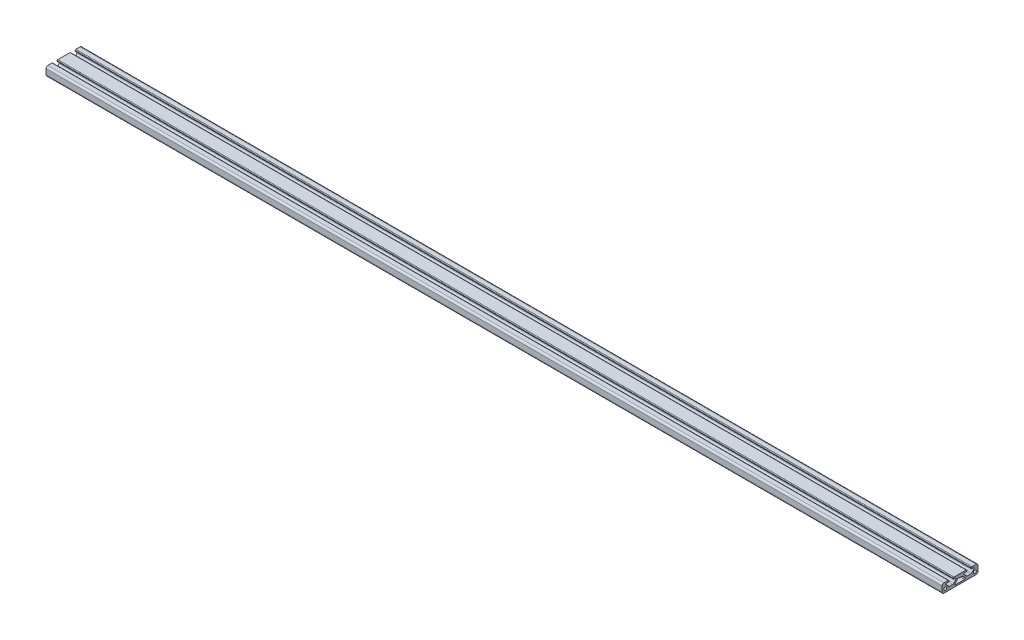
from build123d import *

# Parameters (mm, degrees)
MODEL_R                = 1.65
STRUKTURBAUTEIL1_DEPTH = 1000


with BuildPart() as part:
    # Model → Strukturbauteil1 (new body)
    with BuildSketch(Plane(origin=(0, 0, 0), x_dir=(0, 0, -1), z_dir=(1, 0, 0))):
        with BuildLine():
            Line((7, 3.2), (4.989946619, 3.2))
            ThreePointArc((4.989946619, 3.2), (4.342031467, 2.817442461), (4.364069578, 2.065339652))
            Line((4.364069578, 2.065339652), (5.520694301, 0.503644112))
            Line((5.520694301, 0.503644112), (6.897199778, -0.868181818))
            ThreePointArc((6.897199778, -0.868181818), (7.5050378, -1.225681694), (8.199169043, -1.35))
            Line((8.199169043, -1.35), (11.800830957, -1.35))
            ThreePointArc((11.800830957, -1.35), (12.4949622, -1.225681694), (13.102800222, -0.868181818))
            Line((13.102800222, -0.868181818), (14.479305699, 0.503644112))
            Line((14.479305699, 0.503644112), (15.635930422, 2.065339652))
            ThreePointArc((15.635930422, 2.065339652), (15.657968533, 2.817442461), (15.010053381, 3.2))
            Line((15.010053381, 3.2), (13, 3.2))
            ThreePointArc((13, 3.2), (12.646446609, 3.346446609), (12.5, 3.7))
            Line((12.5, 3.7), (12.5, 4.25))
            ThreePointArc((12.5, 4.25), (12.719669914, 4.780330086), (13.25, 5))
            Line((13.25, 5), (18, 5))
            ThreePointArc((18, 5), (19.414213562, 4.414213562), (20, 3))
            Line((20, 3), (20, -3))
            ThreePointArc((20, -3), (19.414213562, -4.414213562), (18, -5))
            Line((18, -5), (-18, -5))
            ThreePointArc((-18, -5), (-19.414213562, -4.414213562), (-20, -3))
            Line((-20, -3), (-20, 3))
            ThreePointArc((-20, 3), (-19.414213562, 4.414213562), (-18, 5))
            Line((-18, 5), (-13.25, 5))
            ThreePointArc((-13.25, 5), (-12.719669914, 4.780330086), (-12.5, 4.25))
            Line((-12.5, 4.25), (-12.5, 3.7))
            ThreePointArc((-12.5, 3.7), (-12.646446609, 3.346446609), (-13, 3.2))
            Line((-13, 3.2), (-15.010053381, 3.2))
            ThreePointArc((-15.010053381, 3.2), (-15.657968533, 2.817442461), (-15.635930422, 2.065339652))
            Line((-15.635930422, 2.065339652), (-14.479305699, 0.503644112))
            Line((-14.479305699, 0.503644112), (-13.102800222, -0.868181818))
            ThreePointArc((-13.102800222, -0.868181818), (-12.4949622, -1.225681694), (-11.800830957, -1.35))
            Line((-11.800830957, -1.35), (-8.199169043, -1.35))
            ThreePointArc((-8.199169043, -1.35), (-7.5050378, -1.225681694), (-6.897199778, -0.868181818))
            Line((-6.897199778, -0.868181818), (-5.520694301, 0.503644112))
            Line((-5.520694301, 0.503644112), (-4.364069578, 2.065339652))
            ThreePointArc((-4.364069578, 2.065339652), (-4.342031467, 2.817442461), (-4.989946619, 3.2))
            Line((-4.989946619, 3.2), (-7, 3.2))
            ThreePointArc((-7, 3.2), (-7.353553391, 3.346446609), (-7.5, 3.7))
            Line((-7.5, 3.7), (-7.5, 4.25))
            ThreePointArc((-7.5, 4.25), (-7.280330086, 4.780330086), (-6.75, 5))
            Line((-6.75, 5), (6.75, 5))
            ThreePointArc((6.75, 5), (7.280330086, 4.780330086), (7.5, 4.25))
            Line((7.5, 4.25), (7.5, 3.7))
            ThreePointArc((7.5, 3.7), (7.353553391, 3.346446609), (7, 3.2))
        make_face()
        with Locations((-16.5, -1.5)):
            Circle(MODEL_R, mode=Mode.SUBTRACT)
        with Locations((16.5, -1.5)):
            Circle(MODEL_R, mode=Mode.SUBTRACT)
        with BuildLine():
            Line((-5.002295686, -3.3), (5.002295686, -3.3))
            ThreePointArc((5.002295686, -3.3), (5.657036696, -2.913371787), (5.634661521, -2.153328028))
            Line((5.634661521, -2.153328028), (4.484454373, -0.599610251))
            Line((4.484454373, -0.599610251), (3.116561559, 0.766363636))
            ThreePointArc((3.116561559, 0.766363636), (2.507914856, 1.125196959), (1.812475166, 1.25))
            Line((1.812475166, 1.25), (-1.812475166, 1.25))
            ThreePointArc((-1.812475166, 1.25), (-2.507914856, 1.125196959), (-3.116561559, 0.766363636))
            Line((-3.116561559, 0.766363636), (-4.484454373, -0.599610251))
            Line((-4.484454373, -0.599610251), (-5.634661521, -2.153328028))
            ThreePointArc((-5.634661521, -2.153328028), (-5.657036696, -2.913371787), (-5.002295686, -3.3))
        make_face(mode=Mode.SUBTRACT)
    extrude(amount=STRUKTURBAUTEIL1_DEPTH)


solid = part.part
